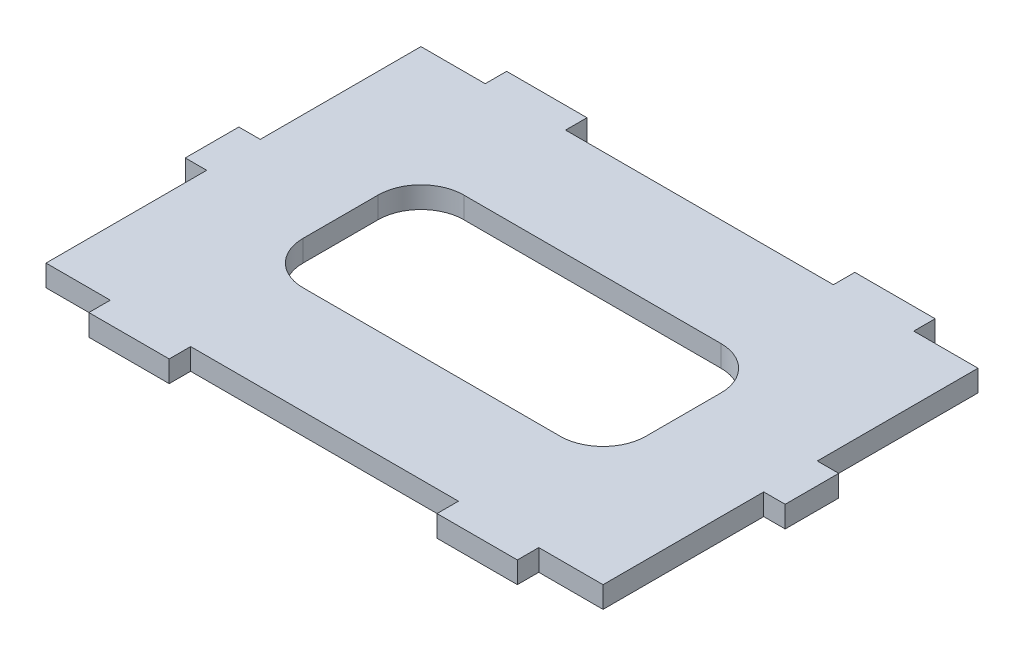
ISO-10303-21;
HEADER;
FILE_DESCRIPTION(('STEP AP214'),'2;1');
FILE_NAME('part.step','',(''),(''),'','','');
FILE_SCHEMA(('AUTOMOTIVE_DESIGN { 1 0 10303 214 1 1 1 1 }'));
ENDSEC;
DATA;
#1=APPLICATION_CONTEXT('core data for automotive mechanical design processes');
#2=APPLICATION_PROTOCOL_DEFINITION('international standard','automotive_design',2000,#1);
#3=PRODUCT_CONTEXT('',#1,'mechanical');
#4=PRODUCT('Part','Part','',(#3));
#5=PRODUCT_RELATED_PRODUCT_CATEGORY('part','',(#4));
#6=PRODUCT_DEFINITION_FORMATION('','',#4);
#7=PRODUCT_DEFINITION_CONTEXT('part definition',#1,'design');
#8=PRODUCT_DEFINITION('design','',#6,#7);
#9=PRODUCT_DEFINITION_SHAPE('','',#8);
#10=(LENGTH_UNIT() NAMED_UNIT(*) SI_UNIT(.MILLI.,.METRE.));
#11=(NAMED_UNIT(*) PLANE_ANGLE_UNIT() SI_UNIT($,.RADIAN.));
#12=(NAMED_UNIT(*) SI_UNIT($,.STERADIAN.) SOLID_ANGLE_UNIT());
#13=UNCERTAINTY_MEASURE_WITH_UNIT(LENGTH_MEASURE(1.E-05),#10,'distance_accuracy_value','');
#14=(GEOMETRIC_REPRESENTATION_CONTEXT(3) GLOBAL_UNCERTAINTY_ASSIGNED_CONTEXT((#13)) GLOBAL_UNIT_ASSIGNED_CONTEXT((#10,
#11,#12)) REPRESENTATION_CONTEXT('',''));
#15=CARTESIAN_POINT('',(0.,0.,0.));
#16=DIRECTION('',(0.,0.,1.));
#17=DIRECTION('',(1.,0.,0.));
#18=AXIS2_PLACEMENT_3D('',#15,#16,#17);
#19=CARTESIAN_POINT('',(0.,4.,0.));
#20=DIRECTION('',(0.,-1.,0.));
#21=DIRECTION('',(0.,0.,-1.));
#22=AXIS2_PLACEMENT_3D('',#19,#20,#21);
#23=PLANE('',#22);
#24=DIRECTION('',(0.,0.,1.));
#25=VECTOR('',#24,1.);
#26=CARTESIAN_POINT('',(-52.,4.,-35.));
#27=LINE('',#26,#25);
#28=CARTESIAN_POINT('',(-52.,4.,-35.));
#29=VERTEX_POINT('',#28);
#30=CARTESIAN_POINT('',(-52.,4.,-5.));
#31=VERTEX_POINT('',#30);
#32=EDGE_CURVE('E331',#29,#31,#27,.T.);
#33=ORIENTED_EDGE('',*,*,#32,.T.);
#34=DIRECTION('',(-1.,0.,0.));
#35=VECTOR('',#34,1.);
#36=CARTESIAN_POINT('',(-52.,4.,-5.));
#37=LINE('',#36,#35);
#38=CARTESIAN_POINT('',(-56.,4.,-5.));
#39=VERTEX_POINT('',#38);
#40=EDGE_CURVE('E334',#31,#39,#37,.T.);
#41=ORIENTED_EDGE('',*,*,#40,.T.);
#42=DIRECTION('',(0.,0.,1.));
#43=VECTOR('',#42,1.);
#44=CARTESIAN_POINT('',(-56.,4.,-5.));
#45=LINE('',#44,#43);
#46=CARTESIAN_POINT('',(-56.,4.,5.));
#47=VERTEX_POINT('',#46);
#48=EDGE_CURVE('E337',#39,#47,#45,.T.);
#49=ORIENTED_EDGE('',*,*,#48,.T.);
#50=DIRECTION('',(1.,0.,0.));
#51=VECTOR('',#50,1.);
#52=CARTESIAN_POINT('',(-52.,4.,5.));
#53=LINE('',#52,#51);
#54=CARTESIAN_POINT('',(-52.,4.,5.));
#55=VERTEX_POINT('',#54);
#56=EDGE_CURVE('E339',#47,#55,#53,.T.);
#57=ORIENTED_EDGE('',*,*,#56,.T.);
#58=DIRECTION('',(0.,0.,1.));
#59=VECTOR('',#58,1.);
#60=CARTESIAN_POINT('',(-52.,4.,5.));
#61=LINE('',#60,#59);
#62=CARTESIAN_POINT('',(-52.,4.,35.));
#63=VERTEX_POINT('',#62);
#64=EDGE_CURVE('E341',#55,#63,#61,.T.);
#65=ORIENTED_EDGE('',*,*,#64,.T.);
#66=DIRECTION('',(1.,0.,0.));
#67=VECTOR('',#66,1.);
#68=CARTESIAN_POINT('',(-52.,4.,35.));
#69=LINE('',#68,#67);
#70=CARTESIAN_POINT('',(-40.,4.,35.));
#71=VERTEX_POINT('',#70);
#72=EDGE_CURVE('E343',#63,#71,#69,.T.);
#73=ORIENTED_EDGE('',*,*,#72,.T.);
#74=DIRECTION('',(0.,0.,1.));
#75=VECTOR('',#74,1.);
#76=CARTESIAN_POINT('',(-40.,4.,35.));
#77=LINE('',#76,#75);
#78=CARTESIAN_POINT('',(-40.,4.,39.));
#79=VERTEX_POINT('',#78);
#80=EDGE_CURVE('E345',#71,#79,#77,.T.);
#81=ORIENTED_EDGE('',*,*,#80,.T.);
#82=DIRECTION('',(1.,0.,0.));
#83=VECTOR('',#82,1.);
#84=CARTESIAN_POINT('',(-40.,4.,39.));
#85=LINE('',#84,#83);
#86=CARTESIAN_POINT('',(-25.,4.,39.));
#87=VERTEX_POINT('',#86);
#88=EDGE_CURVE('E347',#79,#87,#85,.T.);
#89=ORIENTED_EDGE('',*,*,#88,.T.);
#90=DIRECTION('',(0.,0.,-1.));
#91=VECTOR('',#90,1.);
#92=CARTESIAN_POINT('',(-25.,4.,35.));
#93=LINE('',#92,#91);
#94=CARTESIAN_POINT('',(-25.,4.,35.));
#95=VERTEX_POINT('',#94);
#96=EDGE_CURVE('E349',#87,#95,#93,.T.);
#97=ORIENTED_EDGE('',*,*,#96,.T.);
#98=DIRECTION('',(1.,0.,0.));
#99=VECTOR('',#98,1.);
#100=CARTESIAN_POINT('',(-25.,4.,35.));
#101=LINE('',#100,#99);
#102=CARTESIAN_POINT('',(25.,4.,35.));
#103=VERTEX_POINT('',#102);
#104=EDGE_CURVE('E351',#95,#103,#101,.T.);
#105=ORIENTED_EDGE('',*,*,#104,.T.);
#106=DIRECTION('',(0.,0.,1.));
#107=VECTOR('',#106,1.);
#108=CARTESIAN_POINT('',(25.,4.,35.));
#109=LINE('',#108,#107);
#110=CARTESIAN_POINT('',(25.,4.,39.));
#111=VERTEX_POINT('',#110);
#112=EDGE_CURVE('E353',#103,#111,#109,.T.);
#113=ORIENTED_EDGE('',*,*,#112,.T.);
#114=DIRECTION('',(1.,0.,0.));
#115=VECTOR('',#114,1.);
#116=CARTESIAN_POINT('',(40.,4.,39.));
#117=LINE('',#116,#115);
#118=CARTESIAN_POINT('',(40.,4.,39.));
#119=VERTEX_POINT('',#118);
#120=EDGE_CURVE('E355',#111,#119,#117,.T.);
#121=ORIENTED_EDGE('',*,*,#120,.T.);
#122=DIRECTION('',(0.,0.,-1.));
#123=VECTOR('',#122,1.);
#124=CARTESIAN_POINT('',(40.,4.,35.));
#125=LINE('',#124,#123);
#126=CARTESIAN_POINT('',(40.,4.,35.));
#127=VERTEX_POINT('',#126);
#128=EDGE_CURVE('E357',#119,#127,#125,.T.);
#129=ORIENTED_EDGE('',*,*,#128,.T.);
#130=DIRECTION('',(1.,0.,0.));
#131=VECTOR('',#130,1.);
#132=CARTESIAN_POINT('',(40.,4.,35.));
#133=LINE('',#132,#131);
#134=CARTESIAN_POINT('',(52.,4.,35.));
#135=VERTEX_POINT('',#134);
#136=EDGE_CURVE('E359',#127,#135,#133,.T.);
#137=ORIENTED_EDGE('',*,*,#136,.T.);
#138=DIRECTION('',(0.,0.,-1.));
#139=VECTOR('',#138,1.);
#140=CARTESIAN_POINT('',(52.,4.,4.99999999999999));
#141=LINE('',#140,#139);
#142=CARTESIAN_POINT('',(52.,4.,4.99999999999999));
#143=VERTEX_POINT('',#142);
#144=EDGE_CURVE('E361',#135,#143,#141,.T.);
#145=ORIENTED_EDGE('',*,*,#144,.T.);
#146=DIRECTION('',(1.,0.,0.));
#147=VECTOR('',#146,1.);
#148=CARTESIAN_POINT('',(52.,4.,4.99999999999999));
#149=LINE('',#148,#147);
#150=CARTESIAN_POINT('',(56.,4.,4.99999999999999));
#151=VERTEX_POINT('',#150);
#152=EDGE_CURVE('E363',#143,#151,#149,.T.);
#153=ORIENTED_EDGE('',*,*,#152,.T.);
#154=DIRECTION('',(0.,0.,-1.));
#155=VECTOR('',#154,1.);
#156=CARTESIAN_POINT('',(56.,4.,-4.99999999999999));
#157=LINE('',#156,#155);
#158=CARTESIAN_POINT('',(56.,4.,-4.99999999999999));
#159=VERTEX_POINT('',#158);
#160=EDGE_CURVE('E365',#151,#159,#157,.T.);
#161=ORIENTED_EDGE('',*,*,#160,.T.);
#162=DIRECTION('',(-1.,0.,0.));
#163=VECTOR('',#162,1.);
#164=CARTESIAN_POINT('',(52.,4.,-4.99999999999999));
#165=LINE('',#164,#163);
#166=CARTESIAN_POINT('',(52.,4.,-4.99999999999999));
#167=VERTEX_POINT('',#166);
#168=EDGE_CURVE('E367',#159,#167,#165,.T.);
#169=ORIENTED_EDGE('',*,*,#168,.T.);
#170=DIRECTION('',(0.,0.,-1.));
#171=VECTOR('',#170,1.);
#172=CARTESIAN_POINT('',(52.,4.,-35.));
#173=LINE('',#172,#171);
#174=CARTESIAN_POINT('',(52.,4.,-35.));
#175=VERTEX_POINT('',#174);
#176=EDGE_CURVE('E369',#167,#175,#173,.T.);
#177=ORIENTED_EDGE('',*,*,#176,.T.);
#178=DIRECTION('',(-1.,0.,0.));
#179=VECTOR('',#178,1.);
#180=CARTESIAN_POINT('',(40.,4.,-35.));
#181=LINE('',#180,#179);
#182=CARTESIAN_POINT('',(40.,4.,-35.));
#183=VERTEX_POINT('',#182);
#184=EDGE_CURVE('E371',#175,#183,#181,.T.);
#185=ORIENTED_EDGE('',*,*,#184,.T.);
#186=DIRECTION('',(0.,0.,-1.));
#187=VECTOR('',#186,1.);
#188=CARTESIAN_POINT('',(40.,4.,-35.));
#189=LINE('',#188,#187);
#190=CARTESIAN_POINT('',(40.,4.,-39.));
#191=VERTEX_POINT('',#190);
#192=EDGE_CURVE('E373',#183,#191,#189,.T.);
#193=ORIENTED_EDGE('',*,*,#192,.T.);
#194=DIRECTION('',(-1.,0.,0.));
#195=VECTOR('',#194,1.);
#196=CARTESIAN_POINT('',(40.,4.,-39.));
#197=LINE('',#196,#195);
#198=CARTESIAN_POINT('',(25.,4.,-39.));
#199=VERTEX_POINT('',#198);
#200=EDGE_CURVE('E375',#191,#199,#197,.T.);
#201=ORIENTED_EDGE('',*,*,#200,.T.);
#202=DIRECTION('',(0.,0.,1.));
#203=VECTOR('',#202,1.);
#204=CARTESIAN_POINT('',(25.,4.,-35.));
#205=LINE('',#204,#203);
#206=CARTESIAN_POINT('',(25.,4.,-35.));
#207=VERTEX_POINT('',#206);
#208=EDGE_CURVE('E377',#199,#207,#205,.T.);
#209=ORIENTED_EDGE('',*,*,#208,.T.);
#210=DIRECTION('',(-1.,0.,0.));
#211=VECTOR('',#210,1.);
#212=CARTESIAN_POINT('',(-25.,4.,-35.));
#213=LINE('',#212,#211);
#214=CARTESIAN_POINT('',(-25.,4.,-35.));
#215=VERTEX_POINT('',#214);
#216=EDGE_CURVE('E379',#207,#215,#213,.T.);
#217=ORIENTED_EDGE('',*,*,#216,.T.);
#218=DIRECTION('',(0.,0.,-1.));
#219=VECTOR('',#218,1.);
#220=CARTESIAN_POINT('',(-25.,4.,-35.));
#221=LINE('',#220,#219);
#222=CARTESIAN_POINT('',(-25.,4.,-39.));
#223=VERTEX_POINT('',#222);
#224=EDGE_CURVE('E381',#215,#223,#221,.T.);
#225=ORIENTED_EDGE('',*,*,#224,.T.);
#226=DIRECTION('',(-1.,0.,0.));
#227=VECTOR('',#226,1.);
#228=CARTESIAN_POINT('',(-40.,4.,-39.));
#229=LINE('',#228,#227);
#230=CARTESIAN_POINT('',(-40.,4.,-39.));
#231=VERTEX_POINT('',#230);
#232=EDGE_CURVE('E383',#223,#231,#229,.T.);
#233=ORIENTED_EDGE('',*,*,#232,.T.);
#234=DIRECTION('',(0.,0.,1.));
#235=VECTOR('',#234,1.);
#236=CARTESIAN_POINT('',(-40.,4.,-35.));
#237=LINE('',#236,#235);
#238=CARTESIAN_POINT('',(-40.,4.,-35.));
#239=VERTEX_POINT('',#238);
#240=EDGE_CURVE('E385',#231,#239,#237,.T.);
#241=ORIENTED_EDGE('',*,*,#240,.T.);
#242=DIRECTION('',(-1.,0.,0.));
#243=VECTOR('',#242,1.);
#244=CARTESIAN_POINT('',(-52.,4.,-35.));
#245=LINE('',#244,#243);
#246=EDGE_CURVE('E387',#239,#29,#245,.T.);
#247=ORIENTED_EDGE('',*,*,#246,.T.);
#248=EDGE_LOOP('',(#33,#41,#49,#57,#65,#73,#81,#89,#97,#105,#113,#121,#129,#137,#145,#153,#161,
#169,#177,#185,#193,#201,#209,#217,#225,#233,#241,#247));
#249=FACE_BOUND('',#248,.T.);
#250=CARTESIAN_POINT('',(-24.,4.,7.));
#251=DIRECTION('',(0.,1.,0.));
#252=DIRECTION('',(0.,0.,1.));
#253=AXIS2_PLACEMENT_3D('',#250,#251,#252);
#254=CIRCLE('',#253,8.);
#255=CARTESIAN_POINT('',(-32.,4.,7.));
#256=VERTEX_POINT('',#255);
#257=CARTESIAN_POINT('',(-24.,4.,15.));
#258=VERTEX_POINT('',#257);
#259=EDGE_CURVE('E266',#256,#258,#254,.T.);
#260=ORIENTED_EDGE('',*,*,#259,.F.);
#261=DIRECTION('',(0.,0.,1.));
#262=VECTOR('',#261,1.);
#263=CARTESIAN_POINT('',(-32.,4.,-7.));
#264=LINE('',#263,#262);
#265=CARTESIAN_POINT('',(-32.,4.,-7.));
#266=VERTEX_POINT('',#265);
#267=EDGE_CURVE('E299',#266,#256,#264,.T.);
#268=ORIENTED_EDGE('',*,*,#267,.F.);
#269=CARTESIAN_POINT('',(-24.,4.,-7.));
#270=DIRECTION('',(0.,1.,0.));
#271=DIRECTION('',(0.,0.,1.));
#272=AXIS2_PLACEMENT_3D('',#269,#270,#271);
#273=CIRCLE('',#272,8.);
#274=CARTESIAN_POINT('',(-24.,4.,-15.));
#275=VERTEX_POINT('',#274);
#276=EDGE_CURVE('E297',#275,#266,#273,.T.);
#277=ORIENTED_EDGE('',*,*,#276,.F.);
#278=DIRECTION('',(-1.,0.,0.));
#279=VECTOR('',#278,1.);
#280=CARTESIAN_POINT('',(-24.,4.,-15.));
#281=LINE('',#280,#279);
#282=CARTESIAN_POINT('',(24.,4.,-15.));
#283=VERTEX_POINT('',#282);
#284=EDGE_CURVE('E295',#283,#275,#281,.T.);
#285=ORIENTED_EDGE('',*,*,#284,.F.);
#286=CARTESIAN_POINT('',(24.,4.,-7.));
#287=DIRECTION('',(0.,1.,0.));
#288=DIRECTION('',(0.,0.,1.));
#289=AXIS2_PLACEMENT_3D('',#286,#287,#288);
#290=CIRCLE('',#289,8.);
#291=CARTESIAN_POINT('',(32.,4.,-7.));
#292=VERTEX_POINT('',#291);
#293=EDGE_CURVE('E293',#292,#283,#290,.T.);
#294=ORIENTED_EDGE('',*,*,#293,.F.);
#295=DIRECTION('',(0.,0.,-1.));
#296=VECTOR('',#295,1.);
#297=CARTESIAN_POINT('',(32.,4.,-7.));
#298=LINE('',#297,#296);
#299=CARTESIAN_POINT('',(32.,4.,7.));
#300=VERTEX_POINT('',#299);
#301=EDGE_CURVE('E289',#300,#292,#298,.T.);
#302=ORIENTED_EDGE('',*,*,#301,.F.);
#303=CARTESIAN_POINT('',(24.,4.,7.));
#304=DIRECTION('',(0.,1.,0.));
#305=DIRECTION('',(0.,0.,1.));
#306=AXIS2_PLACEMENT_3D('',#303,#304,#305);
#307=CIRCLE('',#306,8.);
#308=CARTESIAN_POINT('',(24.,4.,15.));
#309=VERTEX_POINT('',#308);
#310=EDGE_CURVE('E287',#309,#300,#307,.T.);
#311=ORIENTED_EDGE('',*,*,#310,.F.);
#312=DIRECTION('',(1.,0.,0.));
#313=VECTOR('',#312,1.);
#314=CARTESIAN_POINT('',(-24.,4.,15.));
#315=LINE('',#314,#313);
#316=EDGE_CURVE('E274',#258,#309,#315,.T.);
#317=ORIENTED_EDGE('',*,*,#316,.F.);
#318=EDGE_LOOP('',(#260,#268,#277,#285,#294,#302,#311,#317));
#319=FACE_BOUND('',#318,.T.);
#320=ADVANCED_FACE('F33',(#249,#319),#23,.F.);
#321=CARTESIAN_POINT('',(0.,0.,0.));
#322=DIRECTION('',(0.,-1.,0.));
#323=DIRECTION('',(0.,0.,-1.));
#324=AXIS2_PLACEMENT_3D('',#321,#322,#323);
#325=PLANE('',#324);
#326=DIRECTION('',(0.,0.,1.));
#327=VECTOR('',#326,1.);
#328=CARTESIAN_POINT('',(-52.,0.,-35.));
#329=LINE('',#328,#327);
#330=CARTESIAN_POINT('',(-52.,0.,-35.));
#331=VERTEX_POINT('',#330);
#332=CARTESIAN_POINT('',(-52.,0.,-5.));
#333=VERTEX_POINT('',#332);
#334=EDGE_CURVE('E282',#331,#333,#329,.T.);
#335=ORIENTED_EDGE('',*,*,#334,.F.);
#336=DIRECTION('',(-1.,0.,0.));
#337=VECTOR('',#336,1.);
#338=CARTESIAN_POINT('',(-52.,0.,-35.));
#339=LINE('',#338,#337);
#340=CARTESIAN_POINT('',(-40.,0.,-35.));
#341=VERTEX_POINT('',#340);
#342=EDGE_CURVE('E335',#341,#331,#339,.T.);
#343=ORIENTED_EDGE('',*,*,#342,.F.);
#344=DIRECTION('',(0.,0.,1.));
#345=VECTOR('',#344,1.);
#346=CARTESIAN_POINT('',(-40.,0.,-35.));
#347=LINE('',#346,#345);
#348=CARTESIAN_POINT('',(-40.,0.,-39.));
#349=VERTEX_POINT('',#348);
#350=EDGE_CURVE('E442',#349,#341,#347,.T.);
#351=ORIENTED_EDGE('',*,*,#350,.F.);
#352=DIRECTION('',(-1.,0.,0.));
#353=VECTOR('',#352,1.);
#354=CARTESIAN_POINT('',(-40.,0.,-39.));
#355=LINE('',#354,#353);
#356=CARTESIAN_POINT('',(-25.,0.,-39.));
#357=VERTEX_POINT('',#356);
#358=EDGE_CURVE('E440',#357,#349,#355,.T.);
#359=ORIENTED_EDGE('',*,*,#358,.F.);
#360=DIRECTION('',(0.,0.,-1.));
#361=VECTOR('',#360,1.);
#362=CARTESIAN_POINT('',(-25.,0.,-35.));
#363=LINE('',#362,#361);
#364=CARTESIAN_POINT('',(-25.,0.,-35.));
#365=VERTEX_POINT('',#364);
#366=EDGE_CURVE('E438',#365,#357,#363,.T.);
#367=ORIENTED_EDGE('',*,*,#366,.F.);
#368=DIRECTION('',(-1.,0.,0.));
#369=VECTOR('',#368,1.);
#370=CARTESIAN_POINT('',(-25.,0.,-35.));
#371=LINE('',#370,#369);
#372=CARTESIAN_POINT('',(25.,0.,-35.));
#373=VERTEX_POINT('',#372);
#374=EDGE_CURVE('E436',#373,#365,#371,.T.);
#375=ORIENTED_EDGE('',*,*,#374,.F.);
#376=DIRECTION('',(0.,0.,1.));
#377=VECTOR('',#376,1.);
#378=CARTESIAN_POINT('',(25.,0.,-35.));
#379=LINE('',#378,#377);
#380=CARTESIAN_POINT('',(25.,0.,-39.));
#381=VERTEX_POINT('',#380);
#382=EDGE_CURVE('E434',#381,#373,#379,.T.);
#383=ORIENTED_EDGE('',*,*,#382,.F.);
#384=DIRECTION('',(-1.,0.,0.));
#385=VECTOR('',#384,1.);
#386=CARTESIAN_POINT('',(40.,0.,-39.));
#387=LINE('',#386,#385);
#388=CARTESIAN_POINT('',(40.,0.,-39.));
#389=VERTEX_POINT('',#388);
#390=EDGE_CURVE('E432',#389,#381,#387,.T.);
#391=ORIENTED_EDGE('',*,*,#390,.F.);
#392=DIRECTION('',(0.,0.,-1.));
#393=VECTOR('',#392,1.);
#394=CARTESIAN_POINT('',(40.,0.,-35.));
#395=LINE('',#394,#393);
#396=CARTESIAN_POINT('',(40.,0.,-35.));
#397=VERTEX_POINT('',#396);
#398=EDGE_CURVE('E430',#397,#389,#395,.T.);
#399=ORIENTED_EDGE('',*,*,#398,.F.);
#400=DIRECTION('',(-1.,0.,0.));
#401=VECTOR('',#400,1.);
#402=CARTESIAN_POINT('',(40.,0.,-35.));
#403=LINE('',#402,#401);
#404=CARTESIAN_POINT('',(52.,0.,-35.));
#405=VERTEX_POINT('',#404);
#406=EDGE_CURVE('E428',#405,#397,#403,.T.);
#407=ORIENTED_EDGE('',*,*,#406,.F.);
#408=DIRECTION('',(0.,0.,-1.));
#409=VECTOR('',#408,1.);
#410=CARTESIAN_POINT('',(52.,0.,-35.));
#411=LINE('',#410,#409);
#412=CARTESIAN_POINT('',(52.,0.,-4.99999999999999));
#413=VERTEX_POINT('',#412);
#414=EDGE_CURVE('E426',#413,#405,#411,.T.);
#415=ORIENTED_EDGE('',*,*,#414,.F.);
#416=DIRECTION('',(-1.,0.,0.));
#417=VECTOR('',#416,1.);
#418=CARTESIAN_POINT('',(52.,0.,-4.99999999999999));
#419=LINE('',#418,#417);
#420=CARTESIAN_POINT('',(56.,0.,-4.99999999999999));
#421=VERTEX_POINT('',#420);
#422=EDGE_CURVE('E424',#421,#413,#419,.T.);
#423=ORIENTED_EDGE('',*,*,#422,.F.);
#424=DIRECTION('',(0.,0.,-1.));
#425=VECTOR('',#424,1.);
#426=CARTESIAN_POINT('',(56.,0.,-4.99999999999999));
#427=LINE('',#426,#425);
#428=CARTESIAN_POINT('',(56.,0.,4.99999999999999));
#429=VERTEX_POINT('',#428);
#430=EDGE_CURVE('E422',#429,#421,#427,.T.);
#431=ORIENTED_EDGE('',*,*,#430,.F.);
#432=DIRECTION('',(1.,0.,0.));
#433=VECTOR('',#432,1.);
#434=CARTESIAN_POINT('',(52.,0.,4.99999999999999));
#435=LINE('',#434,#433);
#436=CARTESIAN_POINT('',(52.,0.,4.99999999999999));
#437=VERTEX_POINT('',#436);
#438=EDGE_CURVE('E420',#437,#429,#435,.T.);
#439=ORIENTED_EDGE('',*,*,#438,.F.);
#440=DIRECTION('',(0.,0.,-1.));
#441=VECTOR('',#440,1.);
#442=CARTESIAN_POINT('',(52.,0.,4.99999999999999));
#443=LINE('',#442,#441);
#444=CARTESIAN_POINT('',(52.,0.,35.));
#445=VERTEX_POINT('',#444);
#446=EDGE_CURVE('E418',#445,#437,#443,.T.);
#447=ORIENTED_EDGE('',*,*,#446,.F.);
#448=DIRECTION('',(1.,0.,0.));
#449=VECTOR('',#448,1.);
#450=CARTESIAN_POINT('',(40.,0.,35.));
#451=LINE('',#450,#449);
#452=CARTESIAN_POINT('',(40.,0.,35.));
#453=VERTEX_POINT('',#452);
#454=EDGE_CURVE('E416',#453,#445,#451,.T.);
#455=ORIENTED_EDGE('',*,*,#454,.F.);
#456=DIRECTION('',(0.,0.,-1.));
#457=VECTOR('',#456,1.);
#458=CARTESIAN_POINT('',(40.,0.,35.));
#459=LINE('',#458,#457);
#460=CARTESIAN_POINT('',(40.,0.,39.));
#461=VERTEX_POINT('',#460);
#462=EDGE_CURVE('E414',#461,#453,#459,.T.);
#463=ORIENTED_EDGE('',*,*,#462,.F.);
#464=DIRECTION('',(1.,0.,0.));
#465=VECTOR('',#464,1.);
#466=CARTESIAN_POINT('',(40.,0.,39.));
#467=LINE('',#466,#465);
#468=CARTESIAN_POINT('',(25.,0.,39.));
#469=VERTEX_POINT('',#468);
#470=EDGE_CURVE('E412',#469,#461,#467,.T.);
#471=ORIENTED_EDGE('',*,*,#470,.F.);
#472=DIRECTION('',(0.,0.,1.));
#473=VECTOR('',#472,1.);
#474=CARTESIAN_POINT('',(25.,0.,35.));
#475=LINE('',#474,#473);
#476=CARTESIAN_POINT('',(25.,0.,35.));
#477=VERTEX_POINT('',#476);
#478=EDGE_CURVE('E410',#477,#469,#475,.T.);
#479=ORIENTED_EDGE('',*,*,#478,.F.);
#480=DIRECTION('',(1.,0.,0.));
#481=VECTOR('',#480,1.);
#482=CARTESIAN_POINT('',(-25.,0.,35.));
#483=LINE('',#482,#481);
#484=CARTESIAN_POINT('',(-25.,0.,35.));
#485=VERTEX_POINT('',#484);
#486=EDGE_CURVE('E408',#485,#477,#483,.T.);
#487=ORIENTED_EDGE('',*,*,#486,.F.);
#488=DIRECTION('',(0.,0.,-1.));
#489=VECTOR('',#488,1.);
#490=CARTESIAN_POINT('',(-25.,0.,35.));
#491=LINE('',#490,#489);
#492=CARTESIAN_POINT('',(-25.,0.,39.));
#493=VERTEX_POINT('',#492);
#494=EDGE_CURVE('E406',#493,#485,#491,.T.);
#495=ORIENTED_EDGE('',*,*,#494,.F.);
#496=DIRECTION('',(1.,0.,0.));
#497=VECTOR('',#496,1.);
#498=CARTESIAN_POINT('',(-40.,0.,39.));
#499=LINE('',#498,#497);
#500=CARTESIAN_POINT('',(-40.,0.,39.));
#501=VERTEX_POINT('',#500);
#502=EDGE_CURVE('E404',#501,#493,#499,.T.);
#503=ORIENTED_EDGE('',*,*,#502,.F.);
#504=DIRECTION('',(0.,0.,1.));
#505=VECTOR('',#504,1.);
#506=CARTESIAN_POINT('',(-40.,0.,35.));
#507=LINE('',#506,#505);
#508=CARTESIAN_POINT('',(-40.,0.,35.));
#509=VERTEX_POINT('',#508);
#510=EDGE_CURVE('E402',#509,#501,#507,.T.);
#511=ORIENTED_EDGE('',*,*,#510,.F.);
#512=DIRECTION('',(1.,0.,0.));
#513=VECTOR('',#512,1.);
#514=CARTESIAN_POINT('',(-52.,0.,35.));
#515=LINE('',#514,#513);
#516=CARTESIAN_POINT('',(-52.,0.,35.));
#517=VERTEX_POINT('',#516);
#518=EDGE_CURVE('E400',#517,#509,#515,.T.);
#519=ORIENTED_EDGE('',*,*,#518,.F.);
#520=DIRECTION('',(0.,0.,1.));
#521=VECTOR('',#520,1.);
#522=CARTESIAN_POINT('',(-52.,0.,5.));
#523=LINE('',#522,#521);
#524=CARTESIAN_POINT('',(-52.,0.,5.));
#525=VERTEX_POINT('',#524);
#526=EDGE_CURVE('E398',#525,#517,#523,.T.);
#527=ORIENTED_EDGE('',*,*,#526,.F.);
#528=DIRECTION('',(1.,0.,0.));
#529=VECTOR('',#528,1.);
#530=CARTESIAN_POINT('',(-52.,0.,5.));
#531=LINE('',#530,#529);
#532=CARTESIAN_POINT('',(-56.,0.,5.));
#533=VERTEX_POINT('',#532);
#534=EDGE_CURVE('E396',#533,#525,#531,.T.);
#535=ORIENTED_EDGE('',*,*,#534,.F.);
#536=DIRECTION('',(0.,0.,1.));
#537=VECTOR('',#536,1.);
#538=CARTESIAN_POINT('',(-56.,0.,-5.));
#539=LINE('',#538,#537);
#540=CARTESIAN_POINT('',(-56.,0.,-5.));
#541=VERTEX_POINT('',#540);
#542=EDGE_CURVE('E394',#541,#533,#539,.T.);
#543=ORIENTED_EDGE('',*,*,#542,.F.);
#544=DIRECTION('',(-1.,0.,0.));
#545=VECTOR('',#544,1.);
#546=CARTESIAN_POINT('',(-52.,0.,-5.));
#547=LINE('',#546,#545);
#548=EDGE_CURVE('E392',#333,#541,#547,.T.);
#549=ORIENTED_EDGE('',*,*,#548,.F.);
#550=EDGE_LOOP('',(#335,#343,#351,#359,#367,#375,#383,#391,#399,#407,#415,#423,#431,#439,#447,
#455,#463,#471,#479,#487,#495,#503,#511,#519,#527,#535,#543,#549));
#551=FACE_BOUND('',#550,.T.);
#552=DIRECTION('',(0.,0.,1.));
#553=VECTOR('',#552,1.);
#554=CARTESIAN_POINT('',(-32.,0.,-7.));
#555=LINE('',#554,#553);
#556=CARTESIAN_POINT('',(-32.,0.,-7.));
#557=VERTEX_POINT('',#556);
#558=CARTESIAN_POINT('',(-32.,0.,7.));
#559=VERTEX_POINT('',#558);
#560=EDGE_CURVE('E275',#557,#559,#555,.T.);
#561=ORIENTED_EDGE('',*,*,#560,.T.);
#562=CARTESIAN_POINT('',(-24.,0.,7.));
#563=DIRECTION('',(0.,1.,0.));
#564=DIRECTION('',(0.,0.,1.));
#565=AXIS2_PLACEMENT_3D('',#562,#563,#564);
#566=CIRCLE('',#565,8.);
#567=CARTESIAN_POINT('',(-24.,0.,15.));
#568=VERTEX_POINT('',#567);
#569=EDGE_CURVE('E56',#559,#568,#566,.T.);
#570=ORIENTED_EDGE('',*,*,#569,.T.);
#571=DIRECTION('',(1.,0.,0.));
#572=VECTOR('',#571,1.);
#573=CARTESIAN_POINT('',(-24.,0.,15.));
#574=LINE('',#573,#572);
#575=CARTESIAN_POINT('',(24.,0.,15.));
#576=VERTEX_POINT('',#575);
#577=EDGE_CURVE('E281',#568,#576,#574,.T.);
#578=ORIENTED_EDGE('',*,*,#577,.T.);
#579=CARTESIAN_POINT('',(24.,0.,7.));
#580=DIRECTION('',(0.,1.,0.));
#581=DIRECTION('',(0.,0.,1.));
#582=AXIS2_PLACEMENT_3D('',#579,#580,#581);
#583=CIRCLE('',#582,8.);
#584=CARTESIAN_POINT('',(32.,0.,7.));
#585=VERTEX_POINT('',#584);
#586=EDGE_CURVE('E303',#576,#585,#583,.T.);
#587=ORIENTED_EDGE('',*,*,#586,.T.);
#588=DIRECTION('',(0.,0.,-1.));
#589=VECTOR('',#588,1.);
#590=CARTESIAN_POINT('',(32.,0.,-7.));
#591=LINE('',#590,#589);
#592=CARTESIAN_POINT('',(32.,0.,-7.));
#593=VERTEX_POINT('',#592);
#594=EDGE_CURVE('E306',#585,#593,#591,.T.);
#595=ORIENTED_EDGE('',*,*,#594,.T.);
#596=CARTESIAN_POINT('',(24.,0.,-7.));
#597=DIRECTION('',(0.,1.,0.));
#598=DIRECTION('',(0.,0.,1.));
#599=AXIS2_PLACEMENT_3D('',#596,#597,#598);
#600=CIRCLE('',#599,8.);
#601=CARTESIAN_POINT('',(24.,0.,-15.));
#602=VERTEX_POINT('',#601);
#603=EDGE_CURVE('E309',#593,#602,#600,.T.);
#604=ORIENTED_EDGE('',*,*,#603,.T.);
#605=DIRECTION('',(-1.,0.,0.));
#606=VECTOR('',#605,1.);
#607=CARTESIAN_POINT('',(-24.,0.,-15.));
#608=LINE('',#607,#606);
#609=CARTESIAN_POINT('',(-24.,0.,-15.));
#610=VERTEX_POINT('',#609);
#611=EDGE_CURVE('E312',#602,#610,#608,.T.);
#612=ORIENTED_EDGE('',*,*,#611,.T.);
#613=CARTESIAN_POINT('',(-24.,0.,-7.));
#614=DIRECTION('',(0.,1.,0.));
#615=DIRECTION('',(0.,0.,1.));
#616=AXIS2_PLACEMENT_3D('',#613,#614,#615);
#617=CIRCLE('',#616,8.);
#618=EDGE_CURVE('E315',#610,#557,#617,.T.);
#619=ORIENTED_EDGE('',*,*,#618,.T.);
#620=EDGE_LOOP('',(#561,#570,#578,#587,#595,#604,#612,#619));
#621=FACE_BOUND('',#620,.T.);
#622=ADVANCED_FACE('F532',(#551,#621),#325,.T.);
#623=CARTESIAN_POINT('',(-52.,4.,-35.));
#624=DIRECTION('',(1.,0.,0.));
#625=DIRECTION('',(0.,0.,-1.));
#626=AXIS2_PLACEMENT_3D('',#623,#624,#625);
#627=PLANE('',#626);
#628=ORIENTED_EDGE('',*,*,#334,.T.);
#629=DIRECTION('',(0.,-1.,0.));
#630=VECTOR('',#629,1.);
#631=CARTESIAN_POINT('',(-52.,4.,-5.));
#632=LINE('',#631,#630);
#633=EDGE_CURVE('E11',#31,#333,#632,.T.);
#634=ORIENTED_EDGE('',*,*,#633,.F.);
#635=ORIENTED_EDGE('',*,*,#32,.F.);
#636=DIRECTION('',(0.,-1.,0.));
#637=VECTOR('',#636,1.);
#638=CARTESIAN_POINT('',(-52.,4.,-35.));
#639=LINE('',#638,#637);
#640=EDGE_CURVE('E389',#29,#331,#639,.T.);
#641=ORIENTED_EDGE('',*,*,#640,.T.);
#642=EDGE_LOOP('',(#628,#634,#635,#641));
#643=FACE_BOUND('',#642,.T.);
#644=ADVANCED_FACE('F35',(#643),#627,.F.);
#645=CARTESIAN_POINT('',(-52.,4.,-5.));
#646=DIRECTION('',(0.,0.,1.));
#647=DIRECTION('',(1.,0.,0.));
#648=AXIS2_PLACEMENT_3D('',#645,#646,#647);
#649=PLANE('',#648);
#650=ORIENTED_EDGE('',*,*,#548,.T.);
#651=DIRECTION('',(0.,-1.,0.));
#652=VECTOR('',#651,1.);
#653=CARTESIAN_POINT('',(-56.,4.,-5.));
#654=LINE('',#653,#652);
#655=EDGE_CURVE('E41',#39,#541,#654,.T.);
#656=ORIENTED_EDGE('',*,*,#655,.F.);
#657=ORIENTED_EDGE('',*,*,#40,.F.);
#658=ORIENTED_EDGE('',*,*,#633,.T.);
#659=EDGE_LOOP('',(#650,#656,#657,#658));
#660=FACE_BOUND('',#659,.T.);
#661=ADVANCED_FACE('F549',(#660),#649,.F.);
#662=CARTESIAN_POINT('',(-56.,4.,-5.));
#663=DIRECTION('',(1.,0.,0.));
#664=DIRECTION('',(0.,0.,-1.));
#665=AXIS2_PLACEMENT_3D('',#662,#663,#664);
#666=PLANE('',#665);
#667=ORIENTED_EDGE('',*,*,#542,.T.);
#668=DIRECTION('',(0.,-1.,0.));
#669=VECTOR('',#668,1.);
#670=CARTESIAN_POINT('',(-56.,4.,5.));
#671=LINE('',#670,#669);
#672=EDGE_CURVE('E519',#47,#533,#671,.T.);
#673=ORIENTED_EDGE('',*,*,#672,.F.);
#674=ORIENTED_EDGE('',*,*,#48,.F.);
#675=ORIENTED_EDGE('',*,*,#655,.T.);
#676=EDGE_LOOP('',(#667,#673,#674,#675));
#677=FACE_BOUND('',#676,.T.);
#678=ADVANCED_FACE('F526',(#677),#666,.F.);
#679=CARTESIAN_POINT('',(-52.,4.,5.));
#680=DIRECTION('',(0.,0.,-1.));
#681=DIRECTION('',(-1.,0.,0.));
#682=AXIS2_PLACEMENT_3D('',#679,#680,#681);
#683=PLANE('',#682);
#684=ORIENTED_EDGE('',*,*,#534,.T.);
#685=DIRECTION('',(0.,-1.,0.));
#686=VECTOR('',#685,1.);
#687=CARTESIAN_POINT('',(-52.,4.,5.));
#688=LINE('',#687,#686);
#689=EDGE_CURVE('E516',#55,#525,#688,.T.);
#690=ORIENTED_EDGE('',*,*,#689,.F.);
#691=ORIENTED_EDGE('',*,*,#56,.F.);
#692=ORIENTED_EDGE('',*,*,#672,.T.);
#693=EDGE_LOOP('',(#684,#690,#691,#692));
#694=FACE_BOUND('',#693,.T.);
#695=ADVANCED_FACE('F538',(#694),#683,.F.);
#696=CARTESIAN_POINT('',(-52.,4.,5.));
#697=DIRECTION('',(1.,0.,0.));
#698=DIRECTION('',(0.,0.,-1.));
#699=AXIS2_PLACEMENT_3D('',#696,#697,#698);
#700=PLANE('',#699);
#701=ORIENTED_EDGE('',*,*,#526,.T.);
#702=DIRECTION('',(0.,-1.,0.));
#703=VECTOR('',#702,1.);
#704=CARTESIAN_POINT('',(-52.,4.,35.));
#705=LINE('',#704,#703);
#706=EDGE_CURVE('E513',#63,#517,#705,.T.);
#707=ORIENTED_EDGE('',*,*,#706,.F.);
#708=ORIENTED_EDGE('',*,*,#64,.F.);
#709=ORIENTED_EDGE('',*,*,#689,.T.);
#710=EDGE_LOOP('',(#701,#707,#708,#709));
#711=FACE_BOUND('',#710,.T.);
#712=ADVANCED_FACE('F542',(#711),#700,.F.);
#713=CARTESIAN_POINT('',(-52.,4.,35.));
#714=DIRECTION('',(0.,0.,-1.));
#715=DIRECTION('',(-1.,0.,0.));
#716=AXIS2_PLACEMENT_3D('',#713,#714,#715);
#717=PLANE('',#716);
#718=ORIENTED_EDGE('',*,*,#518,.T.);
#719=DIRECTION('',(0.,-1.,0.));
#720=VECTOR('',#719,1.);
#721=CARTESIAN_POINT('',(-40.,4.,35.));
#722=LINE('',#721,#720);
#723=EDGE_CURVE('E510',#71,#509,#722,.T.);
#724=ORIENTED_EDGE('',*,*,#723,.F.);
#725=ORIENTED_EDGE('',*,*,#72,.F.);
#726=ORIENTED_EDGE('',*,*,#706,.T.);
#727=EDGE_LOOP('',(#718,#724,#725,#726));
#728=FACE_BOUND('',#727,.T.);
#729=ADVANCED_FACE('F662',(#728),#717,.F.);
#730=CARTESIAN_POINT('',(-40.,4.,35.));
#731=DIRECTION('',(1.,0.,0.));
#732=DIRECTION('',(0.,0.,-1.));
#733=AXIS2_PLACEMENT_3D('',#730,#731,#732);
#734=PLANE('',#733);
#735=ORIENTED_EDGE('',*,*,#510,.T.);
#736=DIRECTION('',(0.,-1.,0.));
#737=VECTOR('',#736,1.);
#738=CARTESIAN_POINT('',(-40.,4.,39.));
#739=LINE('',#738,#737);
#740=EDGE_CURVE('E507',#79,#501,#739,.T.);
#741=ORIENTED_EDGE('',*,*,#740,.F.);
#742=ORIENTED_EDGE('',*,*,#80,.F.);
#743=ORIENTED_EDGE('',*,*,#723,.T.);
#744=EDGE_LOOP('',(#735,#741,#742,#743));
#745=FACE_BOUND('',#744,.T.);
#746=ADVANCED_FACE('F659',(#745),#734,.F.);
#747=CARTESIAN_POINT('',(-40.,4.,39.));
#748=DIRECTION('',(0.,0.,-1.));
#749=DIRECTION('',(-1.,0.,0.));
#750=AXIS2_PLACEMENT_3D('',#747,#748,#749);
#751=PLANE('',#750);
#752=ORIENTED_EDGE('',*,*,#502,.T.);
#753=DIRECTION('',(0.,-1.,0.));
#754=VECTOR('',#753,1.);
#755=CARTESIAN_POINT('',(-25.,4.,39.));
#756=LINE('',#755,#754);
#757=EDGE_CURVE('E504',#87,#493,#756,.T.);
#758=ORIENTED_EDGE('',*,*,#757,.F.);
#759=ORIENTED_EDGE('',*,*,#88,.F.);
#760=ORIENTED_EDGE('',*,*,#740,.T.);
#761=EDGE_LOOP('',(#752,#758,#759,#760));
#762=FACE_BOUND('',#761,.T.);
#763=ADVANCED_FACE('F655',(#762),#751,.F.);
#764=CARTESIAN_POINT('',(-25.,4.,35.));
#765=DIRECTION('',(-1.,0.,0.));
#766=DIRECTION('',(0.,0.,1.));
#767=AXIS2_PLACEMENT_3D('',#764,#765,#766);
#768=PLANE('',#767);
#769=ORIENTED_EDGE('',*,*,#494,.T.);
#770=DIRECTION('',(0.,-1.,0.));
#771=VECTOR('',#770,1.);
#772=CARTESIAN_POINT('',(-25.,4.,35.));
#773=LINE('',#772,#771);
#774=EDGE_CURVE('E501',#95,#485,#773,.T.);
#775=ORIENTED_EDGE('',*,*,#774,.F.);
#776=ORIENTED_EDGE('',*,*,#96,.F.);
#777=ORIENTED_EDGE('',*,*,#757,.T.);
#778=EDGE_LOOP('',(#769,#775,#776,#777));
#779=FACE_BOUND('',#778,.T.);
#780=ADVANCED_FACE('F651',(#779),#768,.F.);
#781=CARTESIAN_POINT('',(-25.,4.,35.));
#782=DIRECTION('',(0.,0.,-1.));
#783=DIRECTION('',(-1.,0.,0.));
#784=AXIS2_PLACEMENT_3D('',#781,#782,#783);
#785=PLANE('',#784);
#786=ORIENTED_EDGE('',*,*,#486,.T.);
#787=DIRECTION('',(0.,-1.,0.));
#788=VECTOR('',#787,1.);
#789=CARTESIAN_POINT('',(25.,4.,35.));
#790=LINE('',#789,#788);
#791=EDGE_CURVE('E498',#103,#477,#790,.T.);
#792=ORIENTED_EDGE('',*,*,#791,.F.);
#793=ORIENTED_EDGE('',*,*,#104,.F.);
#794=ORIENTED_EDGE('',*,*,#774,.T.);
#795=EDGE_LOOP('',(#786,#792,#793,#794));
#796=FACE_BOUND('',#795,.T.);
#797=ADVANCED_FACE('F646',(#796),#785,.F.);
#798=CARTESIAN_POINT('',(25.,4.,35.));
#799=DIRECTION('',(1.,0.,0.));
#800=DIRECTION('',(0.,0.,-1.));
#801=AXIS2_PLACEMENT_3D('',#798,#799,#800);
#802=PLANE('',#801);
#803=ORIENTED_EDGE('',*,*,#478,.T.);
#804=DIRECTION('',(0.,-1.,0.));
#805=VECTOR('',#804,1.);
#806=CARTESIAN_POINT('',(25.,4.,39.));
#807=LINE('',#806,#805);
#808=EDGE_CURVE('E495',#111,#469,#807,.T.);
#809=ORIENTED_EDGE('',*,*,#808,.F.);
#810=ORIENTED_EDGE('',*,*,#112,.F.);
#811=ORIENTED_EDGE('',*,*,#791,.T.);
#812=EDGE_LOOP('',(#803,#809,#810,#811));
#813=FACE_BOUND('',#812,.T.);
#814=ADVANCED_FACE('F640',(#813),#802,.F.);
#815=CARTESIAN_POINT('',(40.,4.,39.));
#816=DIRECTION('',(0.,0.,-1.));
#817=DIRECTION('',(-1.,0.,0.));
#818=AXIS2_PLACEMENT_3D('',#815,#816,#817);
#819=PLANE('',#818);
#820=ORIENTED_EDGE('',*,*,#470,.T.);
#821=DIRECTION('',(0.,-1.,0.));
#822=VECTOR('',#821,1.);
#823=CARTESIAN_POINT('',(40.,4.,39.));
#824=LINE('',#823,#822);
#825=EDGE_CURVE('E492',#119,#461,#824,.T.);
#826=ORIENTED_EDGE('',*,*,#825,.F.);
#827=ORIENTED_EDGE('',*,*,#120,.F.);
#828=ORIENTED_EDGE('',*,*,#808,.T.);
#829=EDGE_LOOP('',(#820,#826,#827,#828));
#830=FACE_BOUND('',#829,.T.);
#831=ADVANCED_FACE('F636',(#830),#819,.F.);
#832=CARTESIAN_POINT('',(40.,4.,35.));
#833=DIRECTION('',(-1.,0.,0.));
#834=DIRECTION('',(0.,0.,1.));
#835=AXIS2_PLACEMENT_3D('',#832,#833,#834);
#836=PLANE('',#835);
#837=ORIENTED_EDGE('',*,*,#462,.T.);
#838=DIRECTION('',(0.,-1.,0.));
#839=VECTOR('',#838,1.);
#840=CARTESIAN_POINT('',(40.,4.,35.));
#841=LINE('',#840,#839);
#842=EDGE_CURVE('E489',#127,#453,#841,.T.);
#843=ORIENTED_EDGE('',*,*,#842,.F.);
#844=ORIENTED_EDGE('',*,*,#128,.F.);
#845=ORIENTED_EDGE('',*,*,#825,.T.);
#846=EDGE_LOOP('',(#837,#843,#844,#845));
#847=FACE_BOUND('',#846,.T.);
#848=ADVANCED_FACE('F631',(#847),#836,.F.);
#849=CARTESIAN_POINT('',(40.,4.,35.));
#850=DIRECTION('',(0.,0.,-1.));
#851=DIRECTION('',(-1.,0.,0.));
#852=AXIS2_PLACEMENT_3D('',#849,#850,#851);
#853=PLANE('',#852);
#854=ORIENTED_EDGE('',*,*,#454,.T.);
#855=DIRECTION('',(0.,-1.,0.));
#856=VECTOR('',#855,1.);
#857=CARTESIAN_POINT('',(52.,4.,35.));
#858=LINE('',#857,#856);
#859=EDGE_CURVE('E486',#135,#445,#858,.T.);
#860=ORIENTED_EDGE('',*,*,#859,.F.);
#861=ORIENTED_EDGE('',*,*,#136,.F.);
#862=ORIENTED_EDGE('',*,*,#842,.T.);
#863=EDGE_LOOP('',(#854,#860,#861,#862));
#864=FACE_BOUND('',#863,.T.);
#865=ADVANCED_FACE('F625',(#864),#853,.F.);
#866=CARTESIAN_POINT('',(52.,4.,4.99999999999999));
#867=DIRECTION('',(-1.,0.,0.));
#868=DIRECTION('',(0.,0.,1.));
#869=AXIS2_PLACEMENT_3D('',#866,#867,#868);
#870=PLANE('',#869);
#871=ORIENTED_EDGE('',*,*,#446,.T.);
#872=DIRECTION('',(0.,-1.,0.));
#873=VECTOR('',#872,1.);
#874=CARTESIAN_POINT('',(52.,4.,4.99999999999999));
#875=LINE('',#874,#873);
#876=EDGE_CURVE('E483',#143,#437,#875,.T.);
#877=ORIENTED_EDGE('',*,*,#876,.F.);
#878=ORIENTED_EDGE('',*,*,#144,.F.);
#879=ORIENTED_EDGE('',*,*,#859,.T.);
#880=EDGE_LOOP('',(#871,#877,#878,#879));
#881=FACE_BOUND('',#880,.T.);
#882=ADVANCED_FACE('F621',(#881),#870,.F.);
#883=CARTESIAN_POINT('',(52.,4.,4.99999999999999));
#884=DIRECTION('',(0.,0.,-1.));
#885=DIRECTION('',(-1.,0.,0.));
#886=AXIS2_PLACEMENT_3D('',#883,#884,#885);
#887=PLANE('',#886);
#888=ORIENTED_EDGE('',*,*,#438,.T.);
#889=DIRECTION('',(0.,-1.,0.));
#890=VECTOR('',#889,1.);
#891=CARTESIAN_POINT('',(56.,4.,4.99999999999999));
#892=LINE('',#891,#890);
#893=EDGE_CURVE('E480',#151,#429,#892,.T.);
#894=ORIENTED_EDGE('',*,*,#893,.F.);
#895=ORIENTED_EDGE('',*,*,#152,.F.);
#896=ORIENTED_EDGE('',*,*,#876,.T.);
#897=EDGE_LOOP('',(#888,#894,#895,#896));
#898=FACE_BOUND('',#897,.T.);
#899=ADVANCED_FACE('F616',(#898),#887,.F.);
#900=CARTESIAN_POINT('',(56.,4.,-4.99999999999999));
#901=DIRECTION('',(-1.,0.,0.));
#902=DIRECTION('',(0.,0.,1.));
#903=AXIS2_PLACEMENT_3D('',#900,#901,#902);
#904=PLANE('',#903);
#905=ORIENTED_EDGE('',*,*,#430,.T.);
#906=DIRECTION('',(0.,-1.,0.));
#907=VECTOR('',#906,1.);
#908=CARTESIAN_POINT('',(56.,4.,-4.99999999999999));
#909=LINE('',#908,#907);
#910=EDGE_CURVE('E477',#159,#421,#909,.T.);
#911=ORIENTED_EDGE('',*,*,#910,.F.);
#912=ORIENTED_EDGE('',*,*,#160,.F.);
#913=ORIENTED_EDGE('',*,*,#893,.T.);
#914=EDGE_LOOP('',(#905,#911,#912,#913));
#915=FACE_BOUND('',#914,.T.);
#916=ADVANCED_FACE('F610',(#915),#904,.F.);
#917=CARTESIAN_POINT('',(52.,4.,-4.99999999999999));
#918=DIRECTION('',(0.,0.,1.));
#919=DIRECTION('',(1.,0.,0.));
#920=AXIS2_PLACEMENT_3D('',#917,#918,#919);
#921=PLANE('',#920);
#922=ORIENTED_EDGE('',*,*,#422,.T.);
#923=DIRECTION('',(0.,-1.,0.));
#924=VECTOR('',#923,1.);
#925=CARTESIAN_POINT('',(52.,4.,-4.99999999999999));
#926=LINE('',#925,#924);
#927=EDGE_CURVE('E474',#167,#413,#926,.T.);
#928=ORIENTED_EDGE('',*,*,#927,.F.);
#929=ORIENTED_EDGE('',*,*,#168,.F.);
#930=ORIENTED_EDGE('',*,*,#910,.T.);
#931=EDGE_LOOP('',(#922,#928,#929,#930));
#932=FACE_BOUND('',#931,.T.);
#933=ADVANCED_FACE('F606',(#932),#921,.F.);
#934=CARTESIAN_POINT('',(52.,4.,-35.));
#935=DIRECTION('',(-1.,0.,0.));
#936=DIRECTION('',(0.,0.,1.));
#937=AXIS2_PLACEMENT_3D('',#934,#935,#936);
#938=PLANE('',#937);
#939=ORIENTED_EDGE('',*,*,#414,.T.);
#940=DIRECTION('',(0.,-1.,0.));
#941=VECTOR('',#940,1.);
#942=CARTESIAN_POINT('',(52.,4.,-35.));
#943=LINE('',#942,#941);
#944=EDGE_CURVE('E471',#175,#405,#943,.T.);
#945=ORIENTED_EDGE('',*,*,#944,.F.);
#946=ORIENTED_EDGE('',*,*,#176,.F.);
#947=ORIENTED_EDGE('',*,*,#927,.T.);
#948=EDGE_LOOP('',(#939,#945,#946,#947));
#949=FACE_BOUND('',#948,.T.);
#950=ADVANCED_FACE('F601',(#949),#938,.F.);
#951=CARTESIAN_POINT('',(40.,4.,-35.));
#952=DIRECTION('',(0.,0.,1.));
#953=DIRECTION('',(1.,0.,0.));
#954=AXIS2_PLACEMENT_3D('',#951,#952,#953);
#955=PLANE('',#954);
#956=ORIENTED_EDGE('',*,*,#406,.T.);
#957=DIRECTION('',(0.,-1.,0.));
#958=VECTOR('',#957,1.);
#959=CARTESIAN_POINT('',(40.,4.,-35.));
#960=LINE('',#959,#958);
#961=EDGE_CURVE('E468',#183,#397,#960,.T.);
#962=ORIENTED_EDGE('',*,*,#961,.F.);
#963=ORIENTED_EDGE('',*,*,#184,.F.);
#964=ORIENTED_EDGE('',*,*,#944,.T.);
#965=EDGE_LOOP('',(#956,#962,#963,#964));
#966=FACE_BOUND('',#965,.T.);
#967=ADVANCED_FACE('F595',(#966),#955,.F.);
#968=CARTESIAN_POINT('',(40.,4.,-35.));
#969=DIRECTION('',(-1.,0.,0.));
#970=DIRECTION('',(0.,0.,1.));
#971=AXIS2_PLACEMENT_3D('',#968,#969,#970);
#972=PLANE('',#971);
#973=ORIENTED_EDGE('',*,*,#398,.T.);
#974=DIRECTION('',(0.,-1.,0.));
#975=VECTOR('',#974,1.);
#976=CARTESIAN_POINT('',(40.,4.,-39.));
#977=LINE('',#976,#975);
#978=EDGE_CURVE('E465',#191,#389,#977,.T.);
#979=ORIENTED_EDGE('',*,*,#978,.F.);
#980=ORIENTED_EDGE('',*,*,#192,.F.);
#981=ORIENTED_EDGE('',*,*,#961,.T.);
#982=EDGE_LOOP('',(#973,#979,#980,#981));
#983=FACE_BOUND('',#982,.T.);
#984=ADVANCED_FACE('F591',(#983),#972,.F.);
#985=CARTESIAN_POINT('',(40.,4.,-39.));
#986=DIRECTION('',(0.,0.,1.));
#987=DIRECTION('',(1.,0.,0.));
#988=AXIS2_PLACEMENT_3D('',#985,#986,#987);
#989=PLANE('',#988);
#990=ORIENTED_EDGE('',*,*,#390,.T.);
#991=DIRECTION('',(0.,-1.,0.));
#992=VECTOR('',#991,1.);
#993=CARTESIAN_POINT('',(25.,4.,-39.));
#994=LINE('',#993,#992);
#995=EDGE_CURVE('E462',#199,#381,#994,.T.);
#996=ORIENTED_EDGE('',*,*,#995,.F.);
#997=ORIENTED_EDGE('',*,*,#200,.F.);
#998=ORIENTED_EDGE('',*,*,#978,.T.);
#999=EDGE_LOOP('',(#990,#996,#997,#998));
#1000=FACE_BOUND('',#999,.T.);
#1001=ADVANCED_FACE('F586',(#1000),#989,.F.);
#1002=CARTESIAN_POINT('',(25.,4.,-35.));
#1003=DIRECTION('',(1.,0.,0.));
#1004=DIRECTION('',(0.,0.,-1.));
#1005=AXIS2_PLACEMENT_3D('',#1002,#1003,#1004);
#1006=PLANE('',#1005);
#1007=ORIENTED_EDGE('',*,*,#382,.T.);
#1008=DIRECTION('',(0.,-1.,0.));
#1009=VECTOR('',#1008,1.);
#1010=CARTESIAN_POINT('',(25.,4.,-35.));
#1011=LINE('',#1010,#1009);
#1012=EDGE_CURVE('E459',#207,#373,#1011,.T.);
#1013=ORIENTED_EDGE('',*,*,#1012,.F.);
#1014=ORIENTED_EDGE('',*,*,#208,.F.);
#1015=ORIENTED_EDGE('',*,*,#995,.T.);
#1016=EDGE_LOOP('',(#1007,#1013,#1014,#1015));
#1017=FACE_BOUND('',#1016,.T.);
#1018=ADVANCED_FACE('F580',(#1017),#1006,.F.);
#1019=CARTESIAN_POINT('',(-25.,4.,-35.));
#1020=DIRECTION('',(0.,0.,1.));
#1021=DIRECTION('',(1.,0.,0.));
#1022=AXIS2_PLACEMENT_3D('',#1019,#1020,#1021);
#1023=PLANE('',#1022);
#1024=ORIENTED_EDGE('',*,*,#374,.T.);
#1025=DIRECTION('',(0.,-1.,0.));
#1026=VECTOR('',#1025,1.);
#1027=CARTESIAN_POINT('',(-25.,4.,-35.));
#1028=LINE('',#1027,#1026);
#1029=EDGE_CURVE('E456',#215,#365,#1028,.T.);
#1030=ORIENTED_EDGE('',*,*,#1029,.F.);
#1031=ORIENTED_EDGE('',*,*,#216,.F.);
#1032=ORIENTED_EDGE('',*,*,#1012,.T.);
#1033=EDGE_LOOP('',(#1024,#1030,#1031,#1032));
#1034=FACE_BOUND('',#1033,.T.);
#1035=ADVANCED_FACE('F576',(#1034),#1023,.F.);
#1036=CARTESIAN_POINT('',(-25.,4.,-35.));
#1037=DIRECTION('',(-1.,0.,0.));
#1038=DIRECTION('',(0.,0.,1.));
#1039=AXIS2_PLACEMENT_3D('',#1036,#1037,#1038);
#1040=PLANE('',#1039);
#1041=ORIENTED_EDGE('',*,*,#366,.T.);
#1042=DIRECTION('',(0.,-1.,0.));
#1043=VECTOR('',#1042,1.);
#1044=CARTESIAN_POINT('',(-25.,4.,-39.));
#1045=LINE('',#1044,#1043);
#1046=EDGE_CURVE('E453',#223,#357,#1045,.T.);
#1047=ORIENTED_EDGE('',*,*,#1046,.F.);
#1048=ORIENTED_EDGE('',*,*,#224,.F.);
#1049=ORIENTED_EDGE('',*,*,#1029,.T.);
#1050=EDGE_LOOP('',(#1041,#1047,#1048,#1049));
#1051=FACE_BOUND('',#1050,.T.);
#1052=ADVANCED_FACE('F571',(#1051),#1040,.F.);
#1053=CARTESIAN_POINT('',(-40.,4.,-39.));
#1054=DIRECTION('',(0.,0.,1.));
#1055=DIRECTION('',(1.,0.,0.));
#1056=AXIS2_PLACEMENT_3D('',#1053,#1054,#1055);
#1057=PLANE('',#1056);
#1058=ORIENTED_EDGE('',*,*,#358,.T.);
#1059=DIRECTION('',(0.,-1.,0.));
#1060=VECTOR('',#1059,1.);
#1061=CARTESIAN_POINT('',(-40.,4.,-39.));
#1062=LINE('',#1061,#1060);
#1063=EDGE_CURVE('E450',#231,#349,#1062,.T.);
#1064=ORIENTED_EDGE('',*,*,#1063,.F.);
#1065=ORIENTED_EDGE('',*,*,#232,.F.);
#1066=ORIENTED_EDGE('',*,*,#1046,.T.);
#1067=EDGE_LOOP('',(#1058,#1064,#1065,#1066));
#1068=FACE_BOUND('',#1067,.T.);
#1069=ADVANCED_FACE('F565',(#1068),#1057,.F.);
#1070=CARTESIAN_POINT('',(-40.,4.,-35.));
#1071=DIRECTION('',(1.,0.,0.));
#1072=DIRECTION('',(0.,0.,-1.));
#1073=AXIS2_PLACEMENT_3D('',#1070,#1071,#1072);
#1074=PLANE('',#1073);
#1075=ORIENTED_EDGE('',*,*,#350,.T.);
#1076=DIRECTION('',(0.,-1.,0.));
#1077=VECTOR('',#1076,1.);
#1078=CARTESIAN_POINT('',(-40.,4.,-35.));
#1079=LINE('',#1078,#1077);
#1080=EDGE_CURVE('E447',#239,#341,#1079,.T.);
#1081=ORIENTED_EDGE('',*,*,#1080,.F.);
#1082=ORIENTED_EDGE('',*,*,#240,.F.);
#1083=ORIENTED_EDGE('',*,*,#1063,.T.);
#1084=EDGE_LOOP('',(#1075,#1081,#1082,#1083));
#1085=FACE_BOUND('',#1084,.T.);
#1086=ADVANCED_FACE('F561',(#1085),#1074,.F.);
#1087=CARTESIAN_POINT('',(-52.,4.,-35.));
#1088=DIRECTION('',(0.,0.,1.));
#1089=DIRECTION('',(1.,0.,0.));
#1090=AXIS2_PLACEMENT_3D('',#1087,#1088,#1089);
#1091=PLANE('',#1090);
#1092=ORIENTED_EDGE('',*,*,#342,.T.);
#1093=ORIENTED_EDGE('',*,*,#640,.F.);
#1094=ORIENTED_EDGE('',*,*,#246,.F.);
#1095=ORIENTED_EDGE('',*,*,#1080,.T.);
#1096=EDGE_LOOP('',(#1092,#1093,#1094,#1095));
#1097=FACE_BOUND('',#1096,.T.);
#1098=ADVANCED_FACE('F556',(#1097),#1091,.F.);
#1099=CARTESIAN_POINT('',(-24.,4.,7.));
#1100=DIRECTION('',(0.,-1.,0.));
#1101=DIRECTION('',(0.,0.,-1.));
#1102=AXIS2_PLACEMENT_3D('',#1099,#1100,#1101);
#1103=CYLINDRICAL_SURFACE('',#1102,8.);
#1104=ORIENTED_EDGE('',*,*,#569,.F.);
#1105=DIRECTION('',(0.,-1.,0.));
#1106=VECTOR('',#1105,1.);
#1107=CARTESIAN_POINT('',(-32.,4.,7.));
#1108=LINE('',#1107,#1106);
#1109=EDGE_CURVE('E270',#256,#559,#1108,.T.);
#1110=ORIENTED_EDGE('',*,*,#1109,.F.);
#1111=ORIENTED_EDGE('',*,*,#259,.T.);
#1112=DIRECTION('',(0.,-1.,0.));
#1113=VECTOR('',#1112,1.);
#1114=CARTESIAN_POINT('',(-24.,4.,15.));
#1115=LINE('',#1114,#1113);
#1116=EDGE_CURVE('E269',#258,#568,#1115,.T.);
#1117=ORIENTED_EDGE('',*,*,#1116,.T.);
#1118=EDGE_LOOP('',(#1104,#1110,#1111,#1117));
#1119=FACE_BOUND('',#1118,.T.);
#1120=ADVANCED_FACE('F268',(#1119),#1103,.F.);
#1121=CARTESIAN_POINT('',(-24.,4.,15.));
#1122=DIRECTION('',(0.,0.,-1.));
#1123=DIRECTION('',(-1.,0.,0.));
#1124=AXIS2_PLACEMENT_3D('',#1121,#1122,#1123);
#1125=PLANE('',#1124);
#1126=ORIENTED_EDGE('',*,*,#577,.F.);
#1127=ORIENTED_EDGE('',*,*,#1116,.F.);
#1128=ORIENTED_EDGE('',*,*,#316,.T.);
#1129=DIRECTION('',(0.,-1.,0.));
#1130=VECTOR('',#1129,1.);
#1131=CARTESIAN_POINT('',(24.,4.,15.));
#1132=LINE('',#1131,#1130);
#1133=EDGE_CURVE('E283',#309,#576,#1132,.T.);
#1134=ORIENTED_EDGE('',*,*,#1133,.T.);
#1135=EDGE_LOOP('',(#1126,#1127,#1128,#1134));
#1136=FACE_BOUND('',#1135,.T.);
#1137=ADVANCED_FACE('F278',(#1136),#1125,.T.);
#1138=CARTESIAN_POINT('',(24.,4.,7.));
#1139=DIRECTION('',(0.,-1.,0.));
#1140=DIRECTION('',(0.,0.,-1.));
#1141=AXIS2_PLACEMENT_3D('',#1138,#1139,#1140);
#1142=CYLINDRICAL_SURFACE('',#1141,8.);
#1143=ORIENTED_EDGE('',*,*,#586,.F.);
#1144=ORIENTED_EDGE('',*,*,#1133,.F.);
#1145=ORIENTED_EDGE('',*,*,#310,.T.);
#1146=DIRECTION('',(0.,-1.,0.));
#1147=VECTOR('',#1146,1.);
#1148=CARTESIAN_POINT('',(32.,4.,7.));
#1149=LINE('',#1148,#1147);
#1150=EDGE_CURVE('E328',#300,#585,#1149,.T.);
#1151=ORIENTED_EDGE('',*,*,#1150,.T.);
#1152=EDGE_LOOP('',(#1143,#1144,#1145,#1151));
#1153=FACE_BOUND('',#1152,.T.);
#1154=ADVANCED_FACE('F816',(#1153),#1142,.F.);
#1155=CARTESIAN_POINT('',(32.,4.,-7.));
#1156=DIRECTION('',(-1.,0.,0.));
#1157=DIRECTION('',(0.,0.,1.));
#1158=AXIS2_PLACEMENT_3D('',#1155,#1156,#1157);
#1159=PLANE('',#1158);
#1160=ORIENTED_EDGE('',*,*,#594,.F.);
#1161=ORIENTED_EDGE('',*,*,#1150,.F.);
#1162=ORIENTED_EDGE('',*,*,#301,.T.);
#1163=DIRECTION('',(0.,-1.,0.));
#1164=VECTOR('',#1163,1.);
#1165=CARTESIAN_POINT('',(32.,4.,-7.));
#1166=LINE('',#1165,#1164);
#1167=EDGE_CURVE('E326',#292,#593,#1166,.T.);
#1168=ORIENTED_EDGE('',*,*,#1167,.T.);
#1169=EDGE_LOOP('',(#1160,#1161,#1162,#1168));
#1170=FACE_BOUND('',#1169,.T.);
#1171=ADVANCED_FACE('F822',(#1170),#1159,.T.);
#1172=CARTESIAN_POINT('',(24.,4.,-7.));
#1173=DIRECTION('',(0.,-1.,0.));
#1174=DIRECTION('',(0.,0.,-1.));
#1175=AXIS2_PLACEMENT_3D('',#1172,#1173,#1174);
#1176=CYLINDRICAL_SURFACE('',#1175,8.);
#1177=ORIENTED_EDGE('',*,*,#603,.F.);
#1178=ORIENTED_EDGE('',*,*,#1167,.F.);
#1179=ORIENTED_EDGE('',*,*,#293,.T.);
#1180=DIRECTION('',(0.,-1.,0.));
#1181=VECTOR('',#1180,1.);
#1182=CARTESIAN_POINT('',(24.,4.,-15.));
#1183=LINE('',#1182,#1181);
#1184=EDGE_CURVE('E324',#283,#602,#1183,.T.);
#1185=ORIENTED_EDGE('',*,*,#1184,.T.);
#1186=EDGE_LOOP('',(#1177,#1178,#1179,#1185));
#1187=FACE_BOUND('',#1186,.T.);
#1188=ADVANCED_FACE('F830',(#1187),#1176,.F.);
#1189=CARTESIAN_POINT('',(-24.,4.,-15.));
#1190=DIRECTION('',(0.,0.,1.));
#1191=DIRECTION('',(1.,0.,0.));
#1192=AXIS2_PLACEMENT_3D('',#1189,#1190,#1191);
#1193=PLANE('',#1192);
#1194=ORIENTED_EDGE('',*,*,#611,.F.);
#1195=ORIENTED_EDGE('',*,*,#1184,.F.);
#1196=ORIENTED_EDGE('',*,*,#284,.T.);
#1197=DIRECTION('',(0.,-1.,0.));
#1198=VECTOR('',#1197,1.);
#1199=CARTESIAN_POINT('',(-24.,4.,-15.));
#1200=LINE('',#1199,#1198);
#1201=EDGE_CURVE('E322',#275,#610,#1200,.T.);
#1202=ORIENTED_EDGE('',*,*,#1201,.T.);
#1203=EDGE_LOOP('',(#1194,#1195,#1196,#1202));
#1204=FACE_BOUND('',#1203,.T.);
#1205=ADVANCED_FACE('F838',(#1204),#1193,.T.);
#1206=CARTESIAN_POINT('',(-24.,4.,-7.));
#1207=DIRECTION('',(0.,-1.,0.));
#1208=DIRECTION('',(0.,0.,-1.));
#1209=AXIS2_PLACEMENT_3D('',#1206,#1207,#1208);
#1210=CYLINDRICAL_SURFACE('',#1209,8.);
#1211=ORIENTED_EDGE('',*,*,#618,.F.);
#1212=ORIENTED_EDGE('',*,*,#1201,.F.);
#1213=ORIENTED_EDGE('',*,*,#276,.T.);
#1214=DIRECTION('',(0.,-1.,0.));
#1215=VECTOR('',#1214,1.);
#1216=CARTESIAN_POINT('',(-32.,4.,-7.));
#1217=LINE('',#1216,#1215);
#1218=EDGE_CURVE('E48',#266,#557,#1217,.T.);
#1219=ORIENTED_EDGE('',*,*,#1218,.T.);
#1220=EDGE_LOOP('',(#1211,#1212,#1213,#1219));
#1221=FACE_BOUND('',#1220,.T.);
#1222=ADVANCED_FACE('F846',(#1221),#1210,.F.);
#1223=CARTESIAN_POINT('',(-32.,4.,-7.));
#1224=DIRECTION('',(1.,0.,0.));
#1225=DIRECTION('',(0.,0.,-1.));
#1226=AXIS2_PLACEMENT_3D('',#1223,#1224,#1225);
#1227=PLANE('',#1226);
#1228=ORIENTED_EDGE('',*,*,#560,.F.);
#1229=ORIENTED_EDGE('',*,*,#1218,.F.);
#1230=ORIENTED_EDGE('',*,*,#267,.T.);
#1231=ORIENTED_EDGE('',*,*,#1109,.T.);
#1232=EDGE_LOOP('',(#1228,#1229,#1230,#1231));
#1233=FACE_BOUND('',#1232,.T.);
#1234=ADVANCED_FACE('F854',(#1233),#1227,.T.);
#1235=CLOSED_SHELL('',(#320,#622,#644,#661,#678,#695,#712,#729,#746,#763,#780,#797,#814,#831,
#848,#865,#882,#899,#916,#933,#950,#967,#984,#1001,#1018,#1035,#1052,#1069,#1086,#1098,#1120,
#1137,#1154,#1171,#1188,#1205,#1222,#1234));
#1236=MANIFOLD_SOLID_BREP('B2',#1235);
#1237=ADVANCED_BREP_SHAPE_REPRESENTATION('',(#18,#1236),#14);
#1238=SHAPE_DEFINITION_REPRESENTATION(#9,#1237);
ENDSEC;
END-ISO-10303-21;
